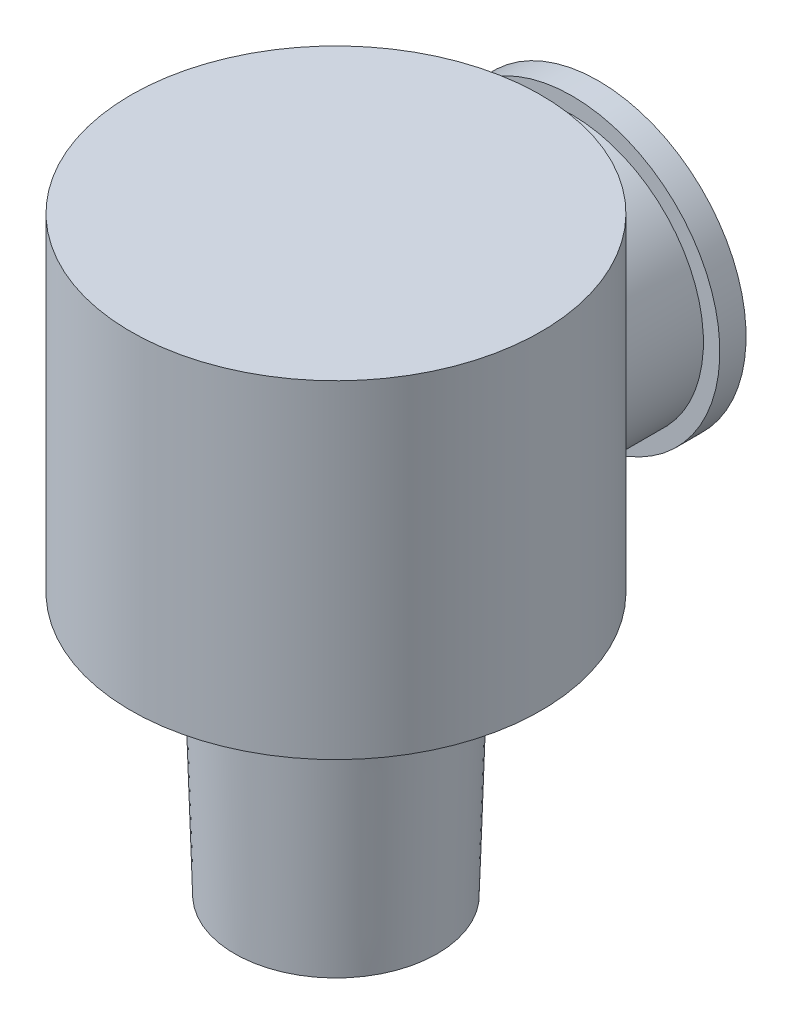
from build123d import *

# Parameters (mm, degrees)
F_3_8_0_375_DIAMETER_HOLE1_D       = 9.525
F_3_8_0_375_DIAMETER_HOLE1_DEPTH   = 15.875
F_3_8_0_375_DIAMETER_HOLE1_TIP     = 2.861598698
F_5_16_0_3125_DIAMETER_HOLE1_D     = 7.9375
F_5_16_0_3125_DIAMETER_HOLE1_DEPTH = 22.225
F_5_16_0_3125_DIAMETER_HOLE1_TIP   = 2.384665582


with BuildPart() as part:
    # Sketch1 → Revolve1 (revolve)
    with BuildSketch(Plane.XY, mode=Mode.PRIVATE) as revolve1_sk:
        Polygon((5.207, 0), (4.90299982, -10.31875), (0, -10.31875), (0, 18.25625), (9.921875, 18.25625), (9.921875, 2.38125), (5.207, 2.38125), align=None)
    revolve(revolve1_sk.sketch.rotate(Axis((0, -10.31875, 0), (0, -1, 0)), 180), axis=Axis((0, -10.31875, 0), (0, -1, 0)))

    # Sketch2 → Revolve2 (revolve)
    with BuildSketch(Plane(origin=(0, 0, 0), x_dir=(0, 0, -1), z_dir=(1, 0, 0)), mode=Mode.PRIVATE) as revolve2_sk:
        Polygon((0, 10.31875), (12.7, 10.31875), (12.7, 17.4625), (11.43, 17.4625), (11.43, 16.66875), (0, 16.66875), align=None)
    revolve(revolve2_sk.sketch.rotate(Axis((0, 10.31875, -12.7), (0, 0, -1)), 180), axis=Axis((0, 10.31875, -12.7), (0, 0, -1)))

    # 3_8 _0.375_ Diameter Hole1
    with Locations(Plane(origin=(0, 0, -12.7), x_dir=(-1, 0, 0), z_dir=(0, 0, -1))):
        with Locations((0, 10.31875)):
            Hole(F_3_8_0_375_DIAMETER_HOLE1_D / 2, depth=F_3_8_0_375_DIAMETER_HOLE1_DEPTH)
            with Locations((0, 0, -(F_3_8_0_375_DIAMETER_HOLE1_DEPTH + F_3_8_0_375_DIAMETER_HOLE1_TIP / 2))):  # 118° drill point
                Cone(0, F_3_8_0_375_DIAMETER_HOLE1_D / 2, F_3_8_0_375_DIAMETER_HOLE1_TIP, mode=Mode.SUBTRACT)

    # 5_16 _0.3125_ Diameter Hole1
    with Locations(Plane.XZ.offset(10.31875)):
        with Locations((0, 0)):
            Hole(F_5_16_0_3125_DIAMETER_HOLE1_D / 2, depth=F_5_16_0_3125_DIAMETER_HOLE1_DEPTH)
            with Locations((0, 0, -(F_5_16_0_3125_DIAMETER_HOLE1_DEPTH + F_5_16_0_3125_DIAMETER_HOLE1_TIP / 2))):  # 118° drill point
                Cone(0, F_5_16_0_3125_DIAMETER_HOLE1_D / 2, F_5_16_0_3125_DIAMETER_HOLE1_TIP, mode=Mode.SUBTRACT)


solid = part.part
